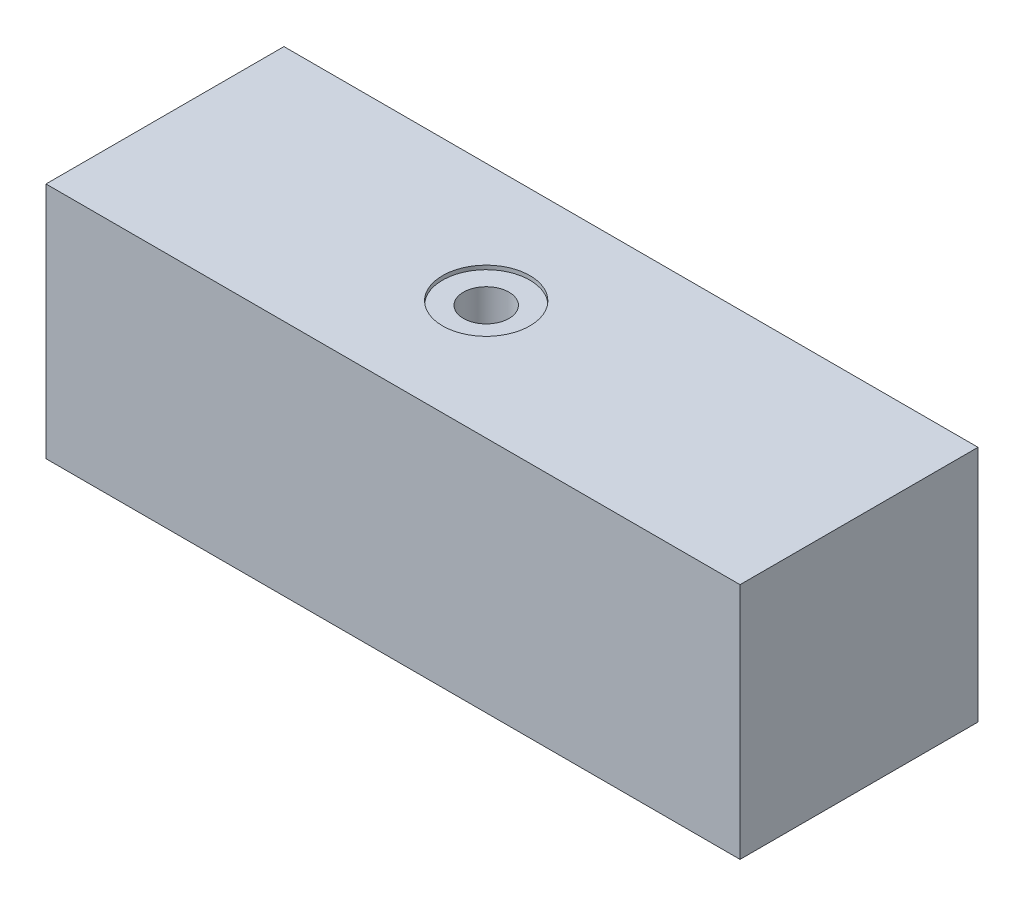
from build123d import *

# Parameters (mm, degrees)
ESQUISSE1_W          = 175
ESQUISSE1_H          = 60
EXTRUSION1_DEPTH     = 60
PER_AGE1_D           = 11.5
PER_AGE1_CBORE_D     = 22
PER_AGE1_CBORE_DEPTH = 1


with BuildPart() as part:
    # Esquisse1 → Extrusion1 (new body)
    with BuildSketch(Plane.XY):
        with Locations((0, 4)):
            Rectangle(ESQUISSE1_W, ESQUISSE1_H)
    extrude(amount=EXTRUSION1_DEPTH)

    # Per_age1 (through all)
    with Locations(Plane(origin=(-6.5, 34, 30), x_dir=(1, 0, 0), z_dir=(0, 1, 0))):
        with Locations((0, 0)):
            CounterBoreHole(PER_AGE1_D / 2, PER_AGE1_CBORE_D / 2, PER_AGE1_CBORE_DEPTH)


solid = part.part
